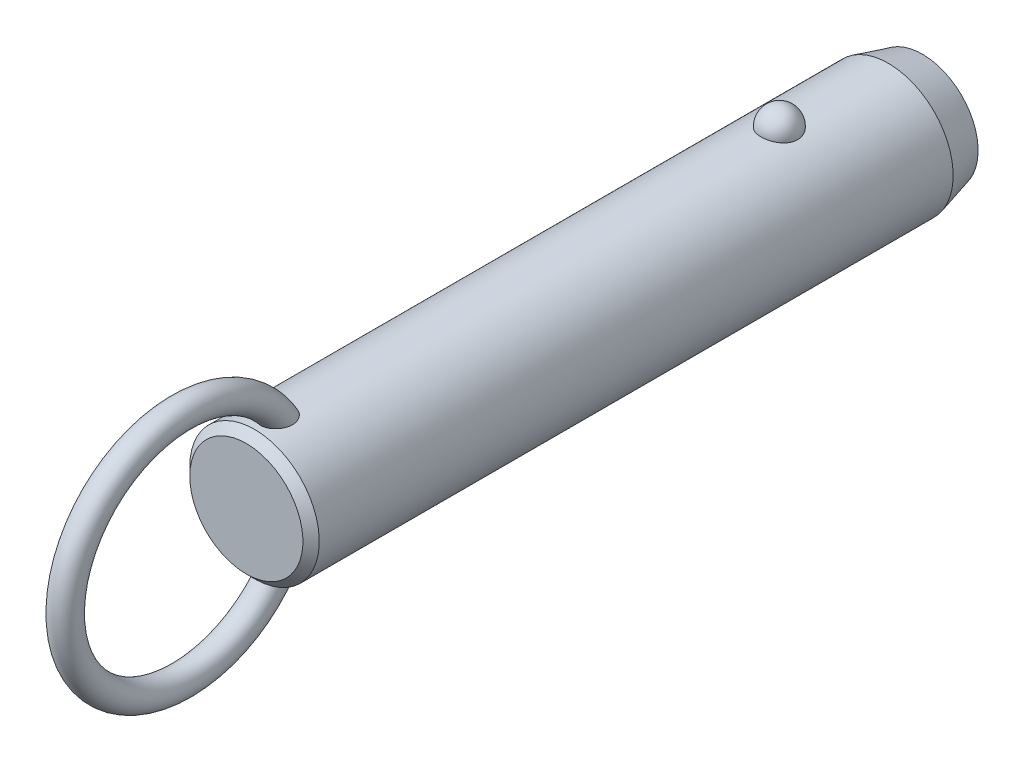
ISO-10303-21;
HEADER;
FILE_DESCRIPTION(('STEP AP214'),'2;1');
FILE_NAME('part.step','',(''),(''),'','','');
FILE_SCHEMA(('AUTOMOTIVE_DESIGN { 1 0 10303 214 1 1 1 1 }'));
ENDSEC;
DATA;
#1=APPLICATION_CONTEXT('core data for automotive mechanical design processes');
#2=APPLICATION_PROTOCOL_DEFINITION('international standard','automotive_design',2000,#1);
#3=PRODUCT_CONTEXT('',#1,'mechanical');
#4=PRODUCT('Part','Part','',(#3));
#5=PRODUCT_RELATED_PRODUCT_CATEGORY('part','',(#4));
#6=PRODUCT_DEFINITION_FORMATION('','',#4);
#7=PRODUCT_DEFINITION_CONTEXT('part definition',#1,'design');
#8=PRODUCT_DEFINITION('design','',#6,#7);
#9=PRODUCT_DEFINITION_SHAPE('','',#8);
#10=(LENGTH_UNIT() NAMED_UNIT(*) SI_UNIT(.MILLI.,.METRE.));
#11=(NAMED_UNIT(*) PLANE_ANGLE_UNIT() SI_UNIT($,.RADIAN.));
#12=(NAMED_UNIT(*) SI_UNIT($,.STERADIAN.) SOLID_ANGLE_UNIT());
#13=UNCERTAINTY_MEASURE_WITH_UNIT(LENGTH_MEASURE(1.E-05),#10,'distance_accuracy_value','');
#14=(GEOMETRIC_REPRESENTATION_CONTEXT(3) GLOBAL_UNCERTAINTY_ASSIGNED_CONTEXT((#13)) GLOBAL_UNIT_ASSIGNED_CONTEXT((#10,
#11,#12)) REPRESENTATION_CONTEXT('',''));
#15=CARTESIAN_POINT('',(0.,0.,0.));
#16=DIRECTION('',(0.,0.,1.));
#17=DIRECTION('',(1.,0.,0.));
#18=AXIS2_PLACEMENT_3D('',#15,#16,#17);
#19=CARTESIAN_POINT('',(0.,0.,66.));
#20=DIRECTION('',(0.,0.,-1.));
#21=DIRECTION('',(-1.,0.,0.));
#22=AXIS2_PLACEMENT_3D('',#19,#20,#21);
#23=CYLINDRICAL_SURFACE('',#22,9.5);
#24=CARTESIAN_POINT('',(2.67259918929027,9.11631578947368,-2.70000000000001));
#25=CARTESIAN_POINT('',(2.6725968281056,9.11631786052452,-2.54909854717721));
#26=CARTESIAN_POINT('',(2.66030567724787,9.11994722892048,-2.39816735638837));
#27=CARTESIAN_POINT('',(2.6114347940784,9.13405924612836,-2.10058568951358));
#28=CARTESIAN_POINT('',(2.57484658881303,9.14454428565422,-1.95393672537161));
#29=CARTESIAN_POINT('',(2.47830875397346,9.17117631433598,-1.66916069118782));
#30=CARTESIAN_POINT('',(2.41836936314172,9.18732082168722,-1.53102991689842));
#31=CARTESIAN_POINT('',(2.27661331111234,9.22346780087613,-1.26705393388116));
#32=CARTESIAN_POINT('',(2.19479699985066,9.24347021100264,-1.14120852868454));
#33=CARTESIAN_POINT('',(2.01085282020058,9.28522401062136,-0.904632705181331));
#34=CARTESIAN_POINT('',(1.90862396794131,9.30698376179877,-0.793982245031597));
#35=CARTESIAN_POINT('',(1.6867437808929,9.34973971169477,-0.591607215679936));
#36=CARTESIAN_POINT('',(1.56709244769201,9.37073591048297,-0.499882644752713));
#37=CARTESIAN_POINT('',(1.31393976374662,9.40956370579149,-0.338167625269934));
#38=CARTESIAN_POINT('',(1.18048026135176,9.42740444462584,-0.268113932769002));
#39=CARTESIAN_POINT('',(0.903154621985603,9.45799906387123,-0.151390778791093));
#40=CARTESIAN_POINT('',(0.759289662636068,9.47075351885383,-0.104718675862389));
#41=CARTESIAN_POINT('',(0.468074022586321,9.48956256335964,-0.0367633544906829));
#42=CARTESIAN_POINT('',(0.320836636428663,9.49573643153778,-0.0150275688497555));
#43=CARTESIAN_POINT('',(0.0246714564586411,9.50112183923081,0.00396199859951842));
#44=CARTESIAN_POINT('',(-0.124256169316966,9.50033406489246,0.00121819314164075));
#45=CARTESIAN_POINT('',(-0.417264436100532,9.4919475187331,-0.0284441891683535));
#46=CARTESIAN_POINT('',(-0.56138413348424,9.48444885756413,-0.0550074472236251));
#47=CARTESIAN_POINT('',(-0.842986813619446,9.46357853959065,-0.131064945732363));
#48=CARTESIAN_POINT('',(-0.980469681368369,9.450206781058,-0.180559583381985));
#49=CARTESIAN_POINT('',(-1.24585005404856,9.41890822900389,-0.301476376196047));
#50=CARTESIAN_POINT('',(-1.37368611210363,9.40095498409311,-0.373026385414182));
#51=CARTESIAN_POINT('',(-1.61552738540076,9.36242964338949,-0.536025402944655));
#52=CARTESIAN_POINT('',(-1.72953116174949,9.34185727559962,-0.627476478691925));
#53=CARTESIAN_POINT('',(-1.9429225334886,9.29984568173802,-0.829844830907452));
#54=CARTESIAN_POINT('',(-2.04198021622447,9.27839736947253,-0.94110821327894));
#55=CARTESIAN_POINT('',(-2.22026460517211,9.23735994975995,-1.17883414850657));
#56=CARTESIAN_POINT('',(-2.29948985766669,9.21777097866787,-1.30529781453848));
#57=CARTESIAN_POINT('',(-2.43697287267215,9.18238994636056,-1.57158566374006));
#58=CARTESIAN_POINT('',(-2.49497068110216,9.16664569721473,-1.71155057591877));
#59=CARTESIAN_POINT('',(-2.5872073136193,9.14104303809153,-1.99961197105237));
#60=CARTESIAN_POINT('',(-2.62144683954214,9.13118445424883,-2.14770821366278));
#61=CARTESIAN_POINT('',(-2.66521466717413,9.11850622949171,-2.44715424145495));
#62=CARTESIAN_POINT('',(-2.67484831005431,9.11565658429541,-2.59848735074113));
#63=CARTESIAN_POINT('',(-2.66946735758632,9.11723375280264,-2.90067317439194));
#64=CARTESIAN_POINT('',(-2.65445345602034,9.12166036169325,-3.05152590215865));
#65=CARTESIAN_POINT('',(-2.60029711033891,9.13724422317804,-3.34766110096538));
#66=CARTESIAN_POINT('',(-2.56127978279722,9.14836656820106,-3.49296833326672));
#67=CARTESIAN_POINT('',(-2.46018844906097,9.17606676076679,-3.77477535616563));
#68=CARTESIAN_POINT('',(-2.39811349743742,9.1926448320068,-3.9112747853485));
#69=CARTESIAN_POINT('',(-2.25202303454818,9.22952198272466,-4.17244273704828));
#70=CARTESIAN_POINT('',(-2.16788714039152,9.24984129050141,-4.29704106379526));
#71=CARTESIAN_POINT('',(-1.9799408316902,9.29188255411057,-4.53013066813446));
#72=CARTESIAN_POINT('',(-1.87612963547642,9.31360456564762,-4.63862130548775));
#73=CARTESIAN_POINT('',(-1.65105429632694,9.35612959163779,-4.8369029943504));
#74=CARTESIAN_POINT('',(-1.52972405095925,9.37692871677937,-4.92661991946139));
#75=CARTESIAN_POINT('',(-1.27318250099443,9.41518970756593,-5.08429106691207));
#76=CARTESIAN_POINT('',(-1.13797219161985,9.432651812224,-5.15224684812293));
#77=CARTESIAN_POINT('',(-0.859280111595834,9.46208255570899,-5.26371827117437));
#78=CARTESIAN_POINT('',(-0.715925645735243,9.47411833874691,-5.30753421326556));
#79=CARTESIAN_POINT('',(-0.423550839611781,9.4916822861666,-5.37076321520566));
#80=CARTESIAN_POINT('',(-0.2745312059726,9.49721125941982,-5.39017930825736));
#81=CARTESIAN_POINT('',(0.0218446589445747,9.50110860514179,-5.40390587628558));
#82=CARTESIAN_POINT('',(0.16917707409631,9.49961381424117,-5.39869609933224));
#83=CARTESIAN_POINT('',(0.460808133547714,9.48993906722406,-5.36441955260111));
#84=CARTESIAN_POINT('',(0.605106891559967,9.48175936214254,-5.33535367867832));
#85=CARTESIAN_POINT('',(0.886027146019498,9.4596376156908,-5.25435587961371));
#86=CARTESIAN_POINT('',(1.02267710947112,9.44571881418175,-5.20251612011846));
#87=CARTESIAN_POINT('',(1.28523827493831,9.41358993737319,-5.07741549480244));
#88=CARTESIAN_POINT('',(1.41114877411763,9.39537958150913,-5.00415322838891));
#89=CARTESIAN_POINT('',(1.65085227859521,9.3562644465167,-4.83684599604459));
#90=CARTESIAN_POINT('',(1.76442346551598,9.33532178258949,-4.74249218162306));
#91=CARTESIAN_POINT('',(1.97425672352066,9.29321198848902,-4.53620389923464));
#92=CARTESIAN_POINT('',(2.07051582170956,9.27204482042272,-4.42426641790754));
#93=CARTESIAN_POINT('',(2.24490086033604,9.23139221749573,-4.18363183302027));
#94=CARTESIAN_POINT('',(2.32267019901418,9.21194380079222,-4.05466990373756));
#95=CARTESIAN_POINT('',(2.45584092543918,9.1773419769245,-3.78517836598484));
#96=CARTESIAN_POINT('',(2.5112497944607,9.16218713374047,-3.64465264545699));
#97=CARTESIAN_POINT('',(2.59380876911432,9.13913522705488,-3.37104301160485));
#98=CARTESIAN_POINT('',(2.62330266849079,9.13064624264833,-3.23871053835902));
#99=CARTESIAN_POINT('',(2.66269870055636,9.11923566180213,-2.97092664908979));
#100=CARTESIAN_POINT('',(2.67260130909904,9.11631393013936,-2.83547530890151));
#101=CARTESIAN_POINT('',(2.67259918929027,9.11631578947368,-2.70000000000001));
#102=B_SPLINE_CURVE_WITH_KNOTS('',3,(#24,#25,#26,#27,#28,#29,#30,#31,#32,#33,#34,#35,#36,#37,
#38,#39,#40,#41,#42,#43,#44,#45,#46,#47,#48,#49,#50,#51,#52,#53,#54,#55,#56,#57,#58,#59,#60,#61,
#62,#63,#64,#65,#66,#67,#68,#69,#70,#71,#72,#73,#74,#75,#76,#77,#78,#79,#80,#81,#82,#83,#84,#85,
#86,#87,#88,#89,#90,#91,#92,#93,#94,#95,#96,#97,#98,#99,#100,#101),.UNSPECIFIED.,.T.,.F.,(4,2,2,
2,2,2,2,2,2,2,2,2,2,2,2,2,2,2,2,2,2,2,2,2,2,2,2,2,2,2,2,2,2,2,2,2,2,2,4),(0.,0.452217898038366,
0.904593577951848,1.35677112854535,1.80894144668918,2.26340676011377,2.71787203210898,
3.17099820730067,3.62407318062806,4.0687883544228,4.51345969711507,4.95160616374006,
5.38976021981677,5.83050358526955,6.27129275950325,6.72071308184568,7.17016633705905,
7.62495278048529,8.07972578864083,8.53254856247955,8.98535859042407,9.43582813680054,
9.88631615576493,10.3393155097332,10.7923328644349,11.2471065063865,11.7018475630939,
12.150795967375,12.599688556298,13.0398725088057,13.4800399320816,13.9184421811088,
14.3568730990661,14.802202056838,15.2476074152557,15.7010097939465,16.1542603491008,
16.5602594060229,16.966248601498),.UNSPECIFIED.);
#103=CARTESIAN_POINT('',(2.67259918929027,9.11631578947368,-2.70000000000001));
#104=VERTEX_POINT('',#103);
#105=EDGE_CURVE('E41',#104,#104,#102,.T.);
#106=ORIENTED_EDGE('',*,*,#105,.T.);
#107=EDGE_LOOP('',(#106));
#108=FACE_BOUND('',#107,.T.);
#109=CARTESIAN_POINT('',(0.,0.,74.32));
#110=DIRECTION('',(0.,0.,1.));
#111=DIRECTION('',(1.,0.,0.));
#112=AXIS2_PLACEMENT_3D('',#109,#110,#111);
#113=CIRCLE('',#112,9.5);
#114=CARTESIAN_POINT('',(-9.50000000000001,0.,74.32));
#115=VERTEX_POINT('',#114);
#116=EDGE_CURVE('E10',#115,#115,#113,.F.);
#117=ORIENTED_EDGE('',*,*,#116,.T.);
#118=EDGE_LOOP('',(#117));
#119=FACE_BOUND('',#118,.T.);
#120=CARTESIAN_POINT('',(-0.697062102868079,-9.47439269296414,68.6678088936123));
#121=CARTESIAN_POINT('',(-0.799579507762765,-9.46685146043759,68.7074823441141));
#122=CARTESIAN_POINT('',(-0.898575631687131,-9.45788043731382,68.7559309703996));
#123=CARTESIAN_POINT('',(-1.08670047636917,-9.43811593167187,68.8688685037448));
#124=CARTESIAN_POINT('',(-1.17583204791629,-9.42732297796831,68.9333527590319));
#125=CARTESIAN_POINT('',(-1.34179806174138,-9.40513672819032,69.0762099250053));
#126=CARTESIAN_POINT('',(-1.41865133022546,-9.39374438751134,69.154561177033));
#127=CARTESIAN_POINT('',(-1.5586004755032,-9.37154196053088,69.3227524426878));
#128=CARTESIAN_POINT('',(-1.62169476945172,-9.3607319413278,69.4125937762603));
#129=CARTESIAN_POINT('',(-1.73527695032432,-9.34035749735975,69.6045001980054));
#130=CARTESIAN_POINT('',(-1.7852226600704,-9.33085270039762,69.7068910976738));
#131=CARTESIAN_POINT('',(-1.86924997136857,-9.3143834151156,69.918148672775));
#132=CARTESIAN_POINT('',(-1.90332570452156,-9.30741986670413,70.0270177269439));
#133=CARTESIAN_POINT('',(-1.95893603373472,-9.29588482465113,70.2604730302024));
#134=CARTESIAN_POINT('',(-1.97872420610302,-9.29165182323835,70.3854890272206));
#135=CARTESIAN_POINT('',(-2.00062129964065,-9.28695978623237,70.6370805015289));
#136=CARTESIAN_POINT('',(-2.00272284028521,-9.28650232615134,70.763656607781));
#137=CARTESIAN_POINT('',(-1.98958876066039,-9.28932750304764,71.0368157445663));
#138=CARTESIAN_POINT('',(-1.97143366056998,-9.2932400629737,71.1832519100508));
#139=CARTESIAN_POINT('',(-1.91479925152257,-9.30507151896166,71.4720629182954));
#140=CARTESIAN_POINT('',(-1.87629122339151,-9.31299607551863,71.614431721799));
#141=CARTESIAN_POINT('',(-1.77225683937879,-9.33340232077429,71.9151725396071));
#142=CARTESIAN_POINT('',(-1.70334898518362,-9.34641636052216,72.0723691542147));
#143=CARTESIAN_POINT('',(-1.58111062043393,-9.36759153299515,72.2975171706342));
#144=CARTESIAN_POINT('',(-1.53721459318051,-9.37492619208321,72.3707968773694));
#145=CARTESIAN_POINT('',(-1.44302631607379,-9.38988566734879,72.5130740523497));
#146=CARTESIAN_POINT('',(-1.39273721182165,-9.39751033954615,72.5820736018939));
#147=CARTESIAN_POINT('',(-1.26775962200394,-9.41530678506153,72.7369832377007));
#148=CARTESIAN_POINT('',(-1.19052326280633,-9.42548108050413,72.8208712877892));
#149=CARTESIAN_POINT('',(-1.02420241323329,-9.44499825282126,72.9760086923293));
#150=CARTESIAN_POINT('',(-0.935139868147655,-9.45434261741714,73.0472808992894));
#151=CARTESIAN_POINT('',(-0.766610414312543,-9.46930670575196,73.1586955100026));
#152=CARTESIAN_POINT('',(-0.689439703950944,-9.47529223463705,73.2022354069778));
#153=CARTESIAN_POINT('',(-0.528942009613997,-9.48560294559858,73.2763133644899));
#154=CARTESIAN_POINT('',(-0.445620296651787,-9.48992953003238,73.3068624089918));
#155=CARTESIAN_POINT('',(-0.273901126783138,-9.49644161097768,73.3525792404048));
#156=CARTESIAN_POINT('',(-0.185465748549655,-9.49860811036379,73.36761059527));
#157=CARTESIAN_POINT('',(-0.00734541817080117,-9.5004135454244,73.3801494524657));
#158=CARTESIAN_POINT('',(0.0823387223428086,-9.50005405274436,73.3776678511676));
#159=CARTESIAN_POINT('',(0.247679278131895,-9.49708301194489,73.3569959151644));
#160=CARTESIAN_POINT('',(0.323620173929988,-9.49477609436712,73.3409300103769));
#161=CARTESIAN_POINT('',(0.471981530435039,-9.48855917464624,73.2971726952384));
#162=CARTESIAN_POINT('',(0.544400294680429,-9.48464840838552,73.269475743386));
#163=CARTESIAN_POINT('',(0.70894789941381,-9.47398336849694,73.1928026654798));
#164=CARTESIAN_POINT('',(0.799149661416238,-9.46671310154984,73.1397745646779));
#165=CARTESIAN_POINT('',(0.969783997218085,-9.45076225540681,73.0199731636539));
#166=CARTESIAN_POINT('',(1.05019415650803,-9.44207854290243,72.9531692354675));
#167=CARTESIAN_POINT('',(1.23092343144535,-9.42051459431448,72.7807596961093));
#168=CARTESIAN_POINT('',(1.3265249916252,-9.40733378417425,72.6702619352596));
#169=CARTESIAN_POINT('',(1.49893121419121,-9.38140745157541,72.4355614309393));
#170=CARTESIAN_POINT('',(1.57571616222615,-9.36866239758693,72.3113445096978));
#171=CARTESIAN_POINT('',(1.71285426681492,-9.34457644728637,72.0493891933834));
#172=CARTESIAN_POINT('',(1.77266365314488,-9.33328726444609,71.9113623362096));
#173=CARTESIAN_POINT('',(1.87239208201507,-9.31379209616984,71.6280515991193));
#174=CARTESIAN_POINT('',(1.9123015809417,-9.3055875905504,71.482764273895));
#175=CARTESIAN_POINT('',(1.97604189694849,-9.29228394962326,71.1620281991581));
#176=CARTESIAN_POINT('',(1.99587438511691,-9.28797202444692,70.9857248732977));
#177=CARTESIAN_POINT('',(2.0029570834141,-9.28645519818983,70.6324146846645));
#178=CARTESIAN_POINT('',(1.99025930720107,-9.28923895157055,70.4554093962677));
#179=CARTESIAN_POINT('',(1.93735479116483,-9.30038134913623,70.1563381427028));
#180=CARTESIAN_POINT('',(1.90576827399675,-9.30697680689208,70.0326679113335));
#181=CARTESIAN_POINT('',(1.82287484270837,-9.32356855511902,69.792329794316));
#182=CARTESIAN_POINT('',(1.77158213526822,-9.33356239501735,69.6756569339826));
#183=CARTESIAN_POINT('',(1.64885744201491,-9.35602275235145,69.4527061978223));
#184=CARTESIAN_POINT('',(1.57730995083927,-9.36850332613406,69.3464927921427));
#185=CARTESIAN_POINT('',(1.4154326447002,-9.39431873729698,69.1495530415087));
#186=CARTESIAN_POINT('',(1.32510883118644,-9.40765330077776,69.0588217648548));
#187=CARTESIAN_POINT('',(1.13846223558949,-9.43195720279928,68.9050334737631));
#188=CARTESIAN_POINT('',(1.04369890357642,-9.44302894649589,68.8400947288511));
#189=CARTESIAN_POINT('',(0.843965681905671,-9.46296805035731,68.7280388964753));
#190=CARTESIAN_POINT('',(0.739000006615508,-9.47183631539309,68.6809144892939));
#191=CARTESIAN_POINT('',(0.528175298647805,-9.48586140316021,68.6081173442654));
#192=CARTESIAN_POINT('',(0.422686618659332,-9.49119633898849,68.5814024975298));
#193=CARTESIAN_POINT('',(0.208590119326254,-9.49831365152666,68.5460137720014));
#194=CARTESIAN_POINT('',(0.0999817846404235,-9.500095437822,68.5373428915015));
#195=CARTESIAN_POINT('',(-0.126104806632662,-9.49988861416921,68.5383501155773));
#196=CARTESIAN_POINT('',(-0.24357872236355,-9.49757821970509,68.5495942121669));
#197=CARTESIAN_POINT('',(-0.474390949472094,-9.48885165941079,68.593167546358));
#198=CARTESIAN_POINT('',(-0.587729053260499,-9.48243528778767,68.6254978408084));
#199=CARTESIAN_POINT('',(-0.697062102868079,-9.47439269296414,68.6678088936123));
#200=B_SPLINE_CURVE_WITH_KNOTS('',3,(#120,#121,#122,#123,#124,#125,#126,#127,#128,#129,#130,
#131,#132,#133,#134,#135,#136,#137,#138,#139,#140,#141,#142,#143,#144,#145,#146,#147,#148,#149,
#150,#151,#152,#153,#154,#155,#156,#157,#158,#159,#160,#161,#162,#163,#164,#165,#166,#167,#168,
#169,#170,#171,#172,#173,#174,#175,#176,#177,#178,#179,#180,#181,#182,#183,#184,#185,#186,#187,
#188,#189,#190,#191,#192,#193,#194,#195,#196,#197,#198,#199),.UNSPECIFIED.,.T.,.F.,(4,2,2,2,2,2,
2,2,2,2,2,2,2,2,2,2,2,2,2,2,2,2,2,2,2,2,2,2,2,2,2,2,2,2,2,2,2,2,2,4),(0.,0.330119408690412,
0.660143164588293,0.989655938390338,1.31920659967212,1.66074728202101,2.00241415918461,
2.38088696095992,2.7595176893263,3.20065679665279,3.6424200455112,4.15620996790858,
4.4131416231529,4.66994734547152,5.01228664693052,5.35399933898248,5.61943037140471,
5.88463652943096,6.15215502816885,6.41950709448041,6.65144391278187,6.88349136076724,
7.19641200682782,7.51003602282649,7.94779711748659,8.38601491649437,8.83699707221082,
9.28819530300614,9.81778662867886,10.3465317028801,10.7284172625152,11.110028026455,
11.4938603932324,11.8775702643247,12.2220189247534,12.5663259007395,12.8915939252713,
13.2169159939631,13.5689650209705,13.9210316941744),.UNSPECIFIED.);
#201=CARTESIAN_POINT('',(-0.697062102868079,-9.47439269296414,68.6678088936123));
#202=VERTEX_POINT('',#201);
#203=EDGE_CURVE('E59',#202,#202,#200,.T.);
#204=ORIENTED_EDGE('',*,*,#203,.T.);
#205=EDGE_LOOP('',(#204));
#206=FACE_BOUND('',#205,.T.);
#207=CARTESIAN_POINT('',(-0.697062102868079,9.47439269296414,68.6678088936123));
#208=CARTESIAN_POINT('',(-0.597792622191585,9.48169483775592,68.6293956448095));
#209=CARTESIAN_POINT('',(-0.495106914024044,9.48766580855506,68.5991682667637));
#210=CARTESIAN_POINT('',(-0.285876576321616,9.49627648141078,68.5560327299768));
#211=CARTESIAN_POINT('',(-0.179324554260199,9.49890941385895,68.5431597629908));
#212=CARTESIAN_POINT('',(0.034415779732,9.50053798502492,68.5351666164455));
#213=CARTESIAN_POINT('',(0.141603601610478,9.49953613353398,68.5400341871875));
#214=CARTESIAN_POINT('',(0.353563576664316,9.49401038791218,68.5673654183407));
#215=CARTESIAN_POINT('',(0.458336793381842,9.48948807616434,68.58982117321));
#216=CARTESIAN_POINT('',(0.66249373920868,9.4774236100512,68.6516719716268));
#217=CARTESIAN_POINT('',(0.761881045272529,9.46988348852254,68.6910556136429));
#218=CARTESIAN_POINT('',(0.952608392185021,9.45260382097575,68.7856342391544));
#219=CARTESIAN_POINT('',(1.04394806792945,9.44286417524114,68.8408299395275));
#220=CARTESIAN_POINT('',(1.21712767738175,9.42211760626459,68.9660662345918));
#221=CARTESIAN_POINT('',(1.29885671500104,9.41109835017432,69.0362579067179));
#222=CARTESIAN_POINT('',(1.44978975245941,9.38903310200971,69.188980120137));
#223=CARTESIAN_POINT('',(1.51899278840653,9.37798710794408,69.2715116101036));
#224=CARTESIAN_POINT('',(1.64602857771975,9.35654375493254,69.4497763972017));
#225=CARTESIAN_POINT('',(1.70333052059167,9.34618688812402,69.5458916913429));
#226=CARTESIAN_POINT('',(1.80259341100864,9.32755128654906,69.745897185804));
#227=CARTESIAN_POINT('',(1.84454942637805,9.31927322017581,69.8497898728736));
#228=CARTESIAN_POINT('',(1.91637039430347,9.30478365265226,70.072213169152));
#229=CARTESIAN_POINT('',(1.944805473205,9.29882552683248,70.1912192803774));
#230=CARTESIAN_POINT('',(1.98449865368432,9.29043398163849,70.4321436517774));
#231=CARTESIAN_POINT('',(1.99574908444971,9.28800213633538,70.5540631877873));
#232=CARTESIAN_POINT('',(2.00275141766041,9.28649645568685,70.8169324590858));
#233=CARTESIAN_POINT('',(1.99588238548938,9.28799035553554,70.9579529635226));
#234=CARTESIAN_POINT('',(1.96270559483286,9.29505517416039,71.2376217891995));
#235=CARTESIAN_POINT('',(1.93637872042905,9.30063010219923,71.376267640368));
#236=CARTESIAN_POINT('',(1.85949176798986,9.31633564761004,71.6725616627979));
#237=CARTESIAN_POINT('',(1.80549792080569,9.3270926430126,71.8292907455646));
#238=CARTESIAN_POINT('',(1.67376869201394,9.3516306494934,72.1322840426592));
#239=CARTESIAN_POINT('',(1.59603181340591,9.36541185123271,72.2785475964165));
#240=CARTESIAN_POINT('',(1.4360277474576,9.39110706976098,72.5258138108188));
#241=CARTESIAN_POINT('',(1.35831795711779,9.40278656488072,72.629791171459));
#242=CARTESIAN_POINT('',(1.18774483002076,9.42585025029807,72.8245347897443));
#243=CARTESIAN_POINT('',(1.09490932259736,9.43723493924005,72.9153247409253));
#244=CARTESIAN_POINT('',(0.921110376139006,9.45552616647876,73.0562033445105));
#245=CARTESIAN_POINT('',(0.843738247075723,9.46281058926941,73.1106563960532));
#246=CARTESIAN_POINT('',(0.681245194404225,9.47589120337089,73.206711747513));
#247=CARTESIAN_POINT('',(0.596135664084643,9.48168953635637,73.2483325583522));
#248=CARTESIAN_POINT('',(0.433779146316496,9.49038144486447,73.3100899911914));
#249=CARTESIAN_POINT('',(0.357459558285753,9.49359170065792,73.3326013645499));
#250=CARTESIAN_POINT('',(0.202074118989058,9.49816761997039,73.3645745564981));
#251=CARTESIAN_POINT('',(0.123010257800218,9.49953459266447,73.3740456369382));
#252=CARTESIAN_POINT('',(-0.0357372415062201,9.50026497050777,73.3791143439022));
#253=CARTESIAN_POINT('',(-0.115421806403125,9.49962433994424,73.3746840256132));
#254=CARTESIAN_POINT('',(-0.272823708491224,9.49640854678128,73.3522962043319));
#255=CARTESIAN_POINT('',(-0.350540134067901,9.4938325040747,73.3343325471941));
#256=CARTESIAN_POINT('',(-0.500580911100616,9.4870946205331,73.2868028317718));
#257=CARTESIAN_POINT('',(-0.57297929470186,9.48296359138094,73.2574618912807));
#258=CARTESIAN_POINT('',(-0.712864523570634,9.47347609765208,73.1890087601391));
#259=CARTESIAN_POINT('',(-0.780349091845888,9.46811906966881,73.1498920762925));
#260=CARTESIAN_POINT('',(-0.946309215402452,9.45329720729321,73.0394327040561));
#261=CARTESIAN_POINT('',(-1.04090230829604,9.44321512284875,72.9623297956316));
#262=CARTESIAN_POINT('',(-1.21661929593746,9.42219227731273,72.7940971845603));
#263=CARTESIAN_POINT('',(-1.29770519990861,9.41124921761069,72.7029292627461));
#264=CARTESIAN_POINT('',(-1.47319646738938,9.38563439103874,72.4761621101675));
#265=CARTESIAN_POINT('',(-1.56208878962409,9.37102009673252,72.3362895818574));
#266=CARTESIAN_POINT('',(-1.71623987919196,9.34401559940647,72.0439503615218));
#267=CARTESIAN_POINT('',(-1.78147866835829,9.33162728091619,71.891473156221));
#268=CARTESIAN_POINT('',(-1.88853837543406,9.31055541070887,71.5756470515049));
#269=CARTESIAN_POINT('',(-1.92998995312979,9.30193076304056,71.4121685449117));
#270=CARTESIAN_POINT('',(-1.98590726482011,9.29015757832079,71.0805268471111));
#271=CARTESIAN_POINT('',(-2.0004070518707,9.2870021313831,70.9123698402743));
#272=CARTESIAN_POINT('',(-1.99964701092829,9.28716218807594,70.6050806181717));
#273=CARTESIAN_POINT('',(-1.98908145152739,9.28945704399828,70.4659362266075));
#274=CARTESIAN_POINT('',(-1.94566294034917,9.29865169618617,70.1911539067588));
#275=CARTESIAN_POINT('',(-1.91282062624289,9.30554929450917,70.055514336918));
#276=CARTESIAN_POINT('',(-1.84582133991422,9.31898248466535,69.8578026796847));
#277=CARTESIAN_POINT('',(-1.82038084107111,9.32400364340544,69.792583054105));
#278=CARTESIAN_POINT('',(-1.7635051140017,9.33492884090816,69.6649033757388));
#279=CARTESIAN_POINT('',(-1.73207305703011,9.34083241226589,69.6024418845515));
#280=CARTESIAN_POINT('',(-1.6632424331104,9.353333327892,69.4809407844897));
#281=CARTESIAN_POINT('',(-1.62584239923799,9.35993084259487,69.4219020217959));
#282=CARTESIAN_POINT('',(-1.54527678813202,9.37356864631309,69.3079875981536));
#283=CARTESIAN_POINT('',(-1.50211241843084,9.38060884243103,69.2531110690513));
#284=CARTESIAN_POINT('',(-1.37681147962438,9.40004442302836,69.1099619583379));
#285=CARTESIAN_POINT('',(-1.28916358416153,9.41261047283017,69.0264295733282));
#286=CARTESIAN_POINT('',(-1.09996826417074,9.43658180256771,68.8772360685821));
#287=CARTESIAN_POINT('',(-0.998461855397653,9.44799034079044,68.8115238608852));
#288=CARTESIAN_POINT('',(-0.860188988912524,9.46103017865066,68.7394367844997));
#289=CARTESIAN_POINT('',(-0.828141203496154,9.46389141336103,68.7238511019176));
#290=CARTESIAN_POINT('',(-0.763210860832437,9.46934915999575,68.6944734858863));
#291=CARTESIAN_POINT('',(-0.730328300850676,9.47194567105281,68.6806815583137));
#292=CARTESIAN_POINT('',(-0.697062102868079,9.47439269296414,68.6678088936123));
#293=B_SPLINE_CURVE_WITH_KNOTS('',3,(#207,#208,#209,#210,#211,#212,#213,#214,#215,#216,#217,
#218,#219,#220,#221,#222,#223,#224,#225,#226,#227,#228,#229,#230,#231,#232,#233,#234,#235,#236,
#237,#238,#239,#240,#241,#242,#243,#244,#245,#246,#247,#248,#249,#250,#251,#252,#253,#254,#255,
#256,#257,#258,#259,#260,#261,#262,#263,#264,#265,#266,#267,#268,#269,#270,#271,#272,#273,#274,
#275,#276,#277,#278,#279,#280,#281,#282,#283,#284,#285,#286,#287,#288,#289,#290,#291,#292),
.UNSPECIFIED.,.T.,.F.,(4,2,2,2,2,2,2,2,2,2,2,2,2,2,2,2,2,2,2,2,2,2,2,2,2,2,2,2,2,2,2,2,2,2,2,2,
2,2,2,2,2,2,4),(0.,0.319942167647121,0.640532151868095,0.960900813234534,1.28112555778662,
1.60113495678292,1.92115886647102,2.24457323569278,2.56801248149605,2.90371927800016,
3.23953387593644,3.60560313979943,3.97183576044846,4.39383693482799,4.81625324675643,
5.31257045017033,5.80891895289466,6.19868344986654,6.58773876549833,6.87145417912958,
7.15475838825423,7.3926375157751,7.63034760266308,7.86853584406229,8.10683246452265,
8.3406366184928,8.57454843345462,8.93983939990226,9.30614105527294,9.8026666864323,
10.2996107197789,10.8040753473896,11.3079021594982,11.7249776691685,12.1418541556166,
12.3521485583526,12.562331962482,12.7725671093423,12.9827582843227,13.3458276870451,
13.7078449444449,13.8150604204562,13.9222762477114),.UNSPECIFIED.);
#294=CARTESIAN_POINT('',(-0.697062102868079,9.47439269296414,68.6678088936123));
#295=VERTEX_POINT('',#294);
#296=EDGE_CURVE('E67',#295,#295,#293,.T.);
#297=ORIENTED_EDGE('',*,*,#296,.T.);
#298=EDGE_LOOP('',(#297));
#299=FACE_BOUND('',#298,.T.);
#300=CARTESIAN_POINT('',(0.,0.,-18.6999999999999));
#301=DIRECTION('',(0.,0.,-1.));
#302=DIRECTION('',(-1.,0.,0.));
#303=AXIS2_PLACEMENT_3D('',#300,#301,#302);
#304=CIRCLE('',#303,9.5);
#305=CARTESIAN_POINT('',(-9.5,0.,-18.6999999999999));
#306=VERTEX_POINT('',#305);
#307=EDGE_CURVE('E56',#306,#306,#304,.F.);
#308=ORIENTED_EDGE('',*,*,#307,.T.);
#309=EDGE_LOOP('',(#308));
#310=FACE_BOUND('',#309,.T.);
#311=ADVANCED_FACE('F37',(#108,#119,#206,#299,#310),#23,.T.);
#312=CARTESIAN_POINT('',(0.,0.,-23.7));
#313=DIRECTION('',(0.,0.,-1.));
#314=DIRECTION('',(-1.,0.,0.));
#315=AXIS2_PLACEMENT_3D('',#312,#313,#314);
#316=PLANE('',#315);
#317=CARTESIAN_POINT('',(0.,0.,-23.7));
#318=DIRECTION('',(0.,0.,-1.));
#319=DIRECTION('',(-1.,0.,0.));
#320=AXIS2_PLACEMENT_3D('',#317,#318,#319);
#321=CIRCLE('',#320,8.16025403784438);
#322=CARTESIAN_POINT('',(-8.16025403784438,0.,-23.7));
#323=VERTEX_POINT('',#322);
#324=EDGE_CURVE('E66',#323,#323,#321,.T.);
#325=ORIENTED_EDGE('',*,*,#324,.T.);
#326=EDGE_LOOP('',(#325));
#327=FACE_BOUND('',#326,.T.);
#328=ADVANCED_FACE('F85',(#327),#316,.T.);
#329=CARTESIAN_POINT('',(0.,0.,-23.7));
#330=DIRECTION('',(0.,0.,1.));
#331=DIRECTION('',(1.,0.,0.));
#332=AXIS2_PLACEMENT_3D('',#329,#330,#331);
#333=CONICAL_SURFACE('',#332,8.16025403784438,0.261799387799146);
#334=ORIENTED_EDGE('',*,*,#307,.F.);
#335=EDGE_LOOP('',(#334));
#336=FACE_BOUND('',#335,.T.);
#337=ORIENTED_EDGE('',*,*,#324,.F.);
#338=EDGE_LOOP('',(#337));
#339=FACE_BOUND('',#338,.T.);
#340=ADVANCED_FACE('F83',(#336,#339),#333,.T.);
#341=CARTESIAN_POINT('',(0.,0.,75.52));
#342=DIRECTION('',(0.,0.,1.));
#343=DIRECTION('',(1.,0.,0.));
#344=AXIS2_PLACEMENT_3D('',#341,#342,#343);
#345=PLANE('',#344);
#346=CARTESIAN_POINT('',(0.,0.,75.52));
#347=DIRECTION('',(0.,0.,1.));
#348=DIRECTION('',(1.,0.,0.));
#349=AXIS2_PLACEMENT_3D('',#346,#347,#348);
#350=CIRCLE('',#349,8.29999999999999);
#351=CARTESIAN_POINT('',(-8.3,0.,75.52));
#352=VERTEX_POINT('',#351);
#353=EDGE_CURVE('E50',#352,#352,#350,.T.);
#354=ORIENTED_EDGE('',*,*,#353,.T.);
#355=EDGE_LOOP('',(#354));
#356=FACE_BOUND('',#355,.T.);
#357=ADVANCED_FACE('F77',(#356),#345,.T.);
#358=CARTESIAN_POINT('',(0.,0.,85.05));
#359=DIRECTION('',(1.,0.,0.));
#360=DIRECTION('',(0.,0.,-1.));
#361=AXIS2_PLACEMENT_3D('',#358,#359,#360);
#362=TOROIDAL_SURFACE('',#361,17.05,2.);
#363=ORIENTED_EDGE('',*,*,#296,.F.);
#364=EDGE_LOOP('',(#363));
#365=FACE_BOUND('',#364,.T.);
#366=ORIENTED_EDGE('',*,*,#203,.F.);
#367=EDGE_LOOP('',(#366));
#368=FACE_BOUND('',#367,.T.);
#369=ADVANCED_FACE('F73',(#365,#368),#362,.T.);
#370=CARTESIAN_POINT('',(0.,0.,75.52));
#371=DIRECTION('',(0.,0.,-1.));
#372=DIRECTION('',(-1.,0.,0.));
#373=AXIS2_PLACEMENT_3D('',#370,#371,#372);
#374=CONICAL_SURFACE('',#373,8.29999999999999,0.785398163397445);
#375=CARTESIAN_POINT('',(-9.50000000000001,0.,74.32));
#376=CARTESIAN_POINT('',(-9.48750000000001,0.,74.3325));
#377=CARTESIAN_POINT('',(-9.47500000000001,0.,74.345));
#378=CARTESIAN_POINT('',(-9.45,0.,74.37));
#379=CARTESIAN_POINT('',(-9.43750000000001,0.,74.3825));
#380=CARTESIAN_POINT('',(-9.41250000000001,0.,74.4075));
#381=CARTESIAN_POINT('',(-9.40000000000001,0.,74.42));
#382=CARTESIAN_POINT('',(-9.37500000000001,0.,74.445));
#383=CARTESIAN_POINT('',(-9.36250000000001,0.,74.4575));
#384=CARTESIAN_POINT('',(-9.33750000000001,0.,74.4825));
#385=CARTESIAN_POINT('',(-9.325,0.,74.495));
#386=CARTESIAN_POINT('',(-9.3,0.,74.52));
#387=CARTESIAN_POINT('',(-9.2875,0.,74.5325));
#388=CARTESIAN_POINT('',(-9.2625,0.,74.5575));
#389=CARTESIAN_POINT('',(-9.25000000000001,0.,74.57));
#390=CARTESIAN_POINT('',(-9.225,0.,74.595));
#391=CARTESIAN_POINT('',(-9.2125,0.,74.6075));
#392=CARTESIAN_POINT('',(-9.1875,0.,74.6325));
#393=CARTESIAN_POINT('',(-9.175,0.,74.645));
#394=CARTESIAN_POINT('',(-9.15000000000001,0.,74.67));
#395=CARTESIAN_POINT('',(-9.1375,0.,74.6825));
#396=CARTESIAN_POINT('',(-9.1125,0.,74.7075));
#397=CARTESIAN_POINT('',(-9.1,0.,74.72));
#398=CARTESIAN_POINT('',(-9.075,0.,74.745));
#399=CARTESIAN_POINT('',(-9.0625,0.,74.7575));
#400=CARTESIAN_POINT('',(-9.0375,0.,74.7825));
#401=CARTESIAN_POINT('',(-9.025,0.,74.795));
#402=CARTESIAN_POINT('',(-9.,0.,74.82));
#403=CARTESIAN_POINT('',(-8.9875,0.,74.8325));
#404=CARTESIAN_POINT('',(-8.9625,0.,74.8575));
#405=CARTESIAN_POINT('',(-8.95,0.,74.87));
#406=CARTESIAN_POINT('',(-8.925,0.,74.895));
#407=CARTESIAN_POINT('',(-8.9125,0.,74.9075));
#408=CARTESIAN_POINT('',(-8.8875,0.,74.9325));
#409=CARTESIAN_POINT('',(-8.875,0.,74.945));
#410=CARTESIAN_POINT('',(-8.85,0.,74.97));
#411=CARTESIAN_POINT('',(-8.8375,0.,74.9825));
#412=CARTESIAN_POINT('',(-8.8125,0.,75.0075));
#413=CARTESIAN_POINT('',(-8.8,0.,75.02));
#414=CARTESIAN_POINT('',(-8.775,0.,75.045));
#415=CARTESIAN_POINT('',(-8.7625,0.,75.0575));
#416=CARTESIAN_POINT('',(-8.7375,0.,75.0825));
#417=CARTESIAN_POINT('',(-8.725,0.,75.095));
#418=CARTESIAN_POINT('',(-8.7,0.,75.12));
#419=CARTESIAN_POINT('',(-8.6875,0.,75.1325));
#420=CARTESIAN_POINT('',(-8.6625,0.,75.1575));
#421=CARTESIAN_POINT('',(-8.65,0.,75.17));
#422=CARTESIAN_POINT('',(-8.625,0.,75.195));
#423=CARTESIAN_POINT('',(-8.6125,0.,75.2075));
#424=CARTESIAN_POINT('',(-8.5875,0.,75.2325));
#425=CARTESIAN_POINT('',(-8.575,0.,75.245));
#426=CARTESIAN_POINT('',(-8.55,0.,75.27));
#427=CARTESIAN_POINT('',(-8.5375,0.,75.2825));
#428=CARTESIAN_POINT('',(-8.5125,0.,75.3075));
#429=CARTESIAN_POINT('',(-8.5,0.,75.32));
#430=CARTESIAN_POINT('',(-8.475,0.,75.345));
#431=CARTESIAN_POINT('',(-8.4625,0.,75.3575));
#432=CARTESIAN_POINT('',(-8.43749999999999,0.,75.3825));
#433=CARTESIAN_POINT('',(-8.425,0.,75.395));
#434=CARTESIAN_POINT('',(-8.4,0.,75.42));
#435=CARTESIAN_POINT('',(-8.3875,0.,75.4325));
#436=CARTESIAN_POINT('',(-8.3625,0.,75.4575));
#437=CARTESIAN_POINT('',(-8.35,0.,75.47));
#438=CARTESIAN_POINT('',(-8.32499999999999,0.,75.495));
#439=CARTESIAN_POINT('',(-8.31249999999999,0.,75.5075));
#440=CARTESIAN_POINT('',(-8.3,0.,75.52));
#441=B_SPLINE_CURVE_WITH_KNOTS('',3,(#375,#376,#377,#378,#379,#380,#381,#382,#383,#384,#385,
#386,#387,#388,#389,#390,#391,#392,#393,#394,#395,#396,#397,#398,#399,#400,#401,#402,#403,#404,
#405,#406,#407,#408,#409,#410,#411,#412,#413,#414,#415,#416,#417,#418,#419,#420,#421,#422,#423,
#424,#425,#426,#427,#428,#429,#430,#431,#432,#433,#434,#435,#436,#437,#438,#439,#440),
.UNSPECIFIED.,.F.,.F.,(4,2,2,2,2,2,2,2,2,2,2,2,2,2,2,2,2,2,2,2,2,2,2,2,2,2,2,2,2,2,2,2,4),(0.,
0.0530330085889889,0.106066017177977,0.159099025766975,0.212132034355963,0.265165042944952,
0.318198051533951,0.371231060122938,0.424264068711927,0.477297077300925,0.530330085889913,
0.583363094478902,0.6363961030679,0.689429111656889,0.742462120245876,0.795495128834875,
0.848528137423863,0.901561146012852,0.95459415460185,1.00762716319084,1.06066017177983,
1.11369318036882,1.16672618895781,1.2197591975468,1.2727922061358,1.32582521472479,
1.37885822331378,1.43189123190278,1.48492424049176,1.53795724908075,1.59099025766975,
1.64402326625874,1.69705627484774),.UNSPECIFIED.);
#442=EDGE_CURVE('BSEAM39',#115,#352,#441,.T.);
#443=ORIENTED_EDGE('',*,*,#116,.F.);
#444=ORIENTED_EDGE('',*,*,#353,.F.);
#445=ORIENTED_EDGE('',*,*,#442,.T.);
#446=ORIENTED_EDGE('',*,*,#442,.F.);
#447=EDGE_LOOP('',(#443,#445,#444,#446));
#448=FACE_BOUND('',#447,.T.);
#449=ADVANCED_FACE('F39',(#448),#374,.T.);
#450=CARTESIAN_POINT('',(0.,9.5,-2.70000000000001));
#451=DIRECTION('',(0.,1.,0.));
#452=DIRECTION('',(0.,0.,-1.));
#453=AXIS2_PLACEMENT_3D('',#450,#451,#452);
#454=SPHERICAL_SURFACE('',#453,2.7);
#455=ORIENTED_EDGE('',*,*,#105,.F.);
#456=EDGE_LOOP('',(#455));
#457=FACE_BOUND('',#456,.T.);
#458=ADVANCED_FACE('F79',(#457),#454,.T.);
#459=CLOSED_SHELL('',(#311,#328,#340,#357,#369,#449,#458));
#460=MANIFOLD_SOLID_BREP('B2',#459);
#461=ADVANCED_BREP_SHAPE_REPRESENTATION('',(#18,#460),#14);
#462=SHAPE_DEFINITION_REPRESENTATION(#9,#461);
ENDSEC;
END-ISO-10303-21;
